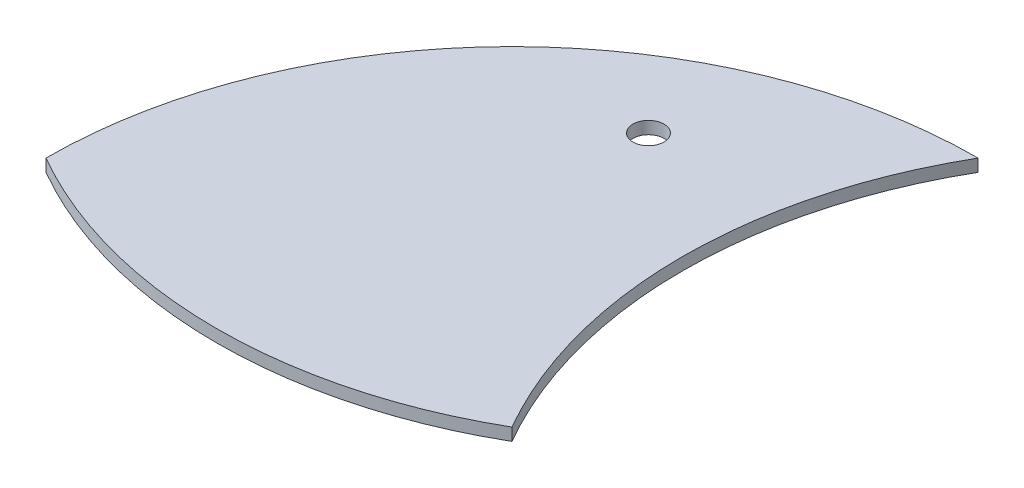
ISO-10303-21;
HEADER;
FILE_DESCRIPTION(('STEP AP214'),'2;1');
FILE_NAME('part.step','',(''),(''),'','','');
FILE_SCHEMA(('AUTOMOTIVE_DESIGN { 1 0 10303 214 1 1 1 1 }'));
ENDSEC;
DATA;
#1=APPLICATION_CONTEXT('core data for automotive mechanical design processes');
#2=APPLICATION_PROTOCOL_DEFINITION('international standard','automotive_design',2000,#1);
#3=PRODUCT_CONTEXT('',#1,'mechanical');
#4=PRODUCT('Part','Part','',(#3));
#5=PRODUCT_RELATED_PRODUCT_CATEGORY('part','',(#4));
#6=PRODUCT_DEFINITION_FORMATION('','',#4);
#7=PRODUCT_DEFINITION_CONTEXT('part definition',#1,'design');
#8=PRODUCT_DEFINITION('design','',#6,#7);
#9=PRODUCT_DEFINITION_SHAPE('','',#8);
#10=(LENGTH_UNIT() NAMED_UNIT(*) SI_UNIT(.MILLI.,.METRE.));
#11=(NAMED_UNIT(*) PLANE_ANGLE_UNIT() SI_UNIT($,.RADIAN.));
#12=(NAMED_UNIT(*) SI_UNIT($,.STERADIAN.) SOLID_ANGLE_UNIT());
#13=UNCERTAINTY_MEASURE_WITH_UNIT(LENGTH_MEASURE(1.E-05),#10,'distance_accuracy_value','');
#14=(GEOMETRIC_REPRESENTATION_CONTEXT(3) GLOBAL_UNCERTAINTY_ASSIGNED_CONTEXT((#13)) GLOBAL_UNIT_ASSIGNED_CONTEXT((#10,
#11,#12)) REPRESENTATION_CONTEXT('',''));
#15=CARTESIAN_POINT('',(0.,0.,0.));
#16=DIRECTION('',(0.,0.,1.));
#17=DIRECTION('',(1.,0.,0.));
#18=AXIS2_PLACEMENT_3D('',#15,#16,#17);
#19=CARTESIAN_POINT('',(32.4759526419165,1.,-18.75));
#20=DIRECTION('',(0.,-1.,0.));
#21=DIRECTION('',(0.,0.,-1.));
#22=AXIS2_PLACEMENT_3D('',#19,#20,#21);
#23=CYLINDRICAL_SURFACE('',#22,37.5);
#24=CARTESIAN_POINT('',(32.4759526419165,0.,-18.75));
#25=DIRECTION('',(0.,1.,0.));
#26=DIRECTION('',(0.,0.,1.));
#27=AXIS2_PLACEMENT_3D('',#24,#25,#26);
#28=CIRCLE('',#27,37.5);
#29=CARTESIAN_POINT('',(0.,0.,-37.5));
#30=VERTEX_POINT('',#29);
#31=CARTESIAN_POINT('',(0.,0.,0.));
#32=VERTEX_POINT('',#31);
#33=EDGE_CURVE('E77',#30,#32,#28,.T.);
#34=ORIENTED_EDGE('',*,*,#33,.F.);
#35=DIRECTION('',(0.,-1.,0.));
#36=VECTOR('',#35,1.);
#37=CARTESIAN_POINT('',(0.,1.,-37.5));
#38=LINE('',#37,#36);
#39=CARTESIAN_POINT('',(0.,1.,-37.5));
#40=VERTEX_POINT('',#39);
#41=EDGE_CURVE('E11',#40,#30,#38,.T.);
#42=ORIENTED_EDGE('',*,*,#41,.F.);
#43=CARTESIAN_POINT('',(32.4759526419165,1.,-18.75));
#44=DIRECTION('',(0.,1.,0.));
#45=DIRECTION('',(0.,0.,1.));
#46=AXIS2_PLACEMENT_3D('',#43,#44,#45);
#47=CIRCLE('',#46,37.5);
#48=CARTESIAN_POINT('',(0.,1.,0.));
#49=VERTEX_POINT('',#48);
#50=EDGE_CURVE('E76',#40,#49,#47,.T.);
#51=ORIENTED_EDGE('',*,*,#50,.T.);
#52=DIRECTION('',(0.,-1.,0.));
#53=VECTOR('',#52,1.);
#54=CARTESIAN_POINT('',(0.,1.,0.));
#55=LINE('',#54,#53);
#56=EDGE_CURVE('E73',#49,#32,#55,.T.);
#57=ORIENTED_EDGE('',*,*,#56,.T.);
#58=EDGE_LOOP('',(#34,#42,#51,#57));
#59=FACE_BOUND('',#58,.T.);
#60=ADVANCED_FACE('F37',(#59),#23,.F.);
#61=CARTESIAN_POINT('',(0.,1.,0.));
#62=DIRECTION('',(0.,-1.,0.));
#63=DIRECTION('',(0.,0.,-1.));
#64=AXIS2_PLACEMENT_3D('',#61,#62,#63);
#65=CYLINDRICAL_SURFACE('',#64,37.5);
#66=CARTESIAN_POINT('',(0.,0.,0.));
#67=DIRECTION('',(0.,1.,0.));
#68=DIRECTION('',(0.,0.,1.));
#69=AXIS2_PLACEMENT_3D('',#66,#67,#68);
#70=CIRCLE('',#69,37.5);
#71=CARTESIAN_POINT('',(-37.5,0.,0.));
#72=VERTEX_POINT('',#71);
#73=EDGE_CURVE('E95',#30,#72,#70,.T.);
#74=ORIENTED_EDGE('',*,*,#73,.T.);
#75=DIRECTION('',(0.,-1.,0.));
#76=VECTOR('',#75,1.);
#77=CARTESIAN_POINT('',(-37.5,1.,0.));
#78=LINE('',#77,#76);
#79=CARTESIAN_POINT('',(-37.5,1.,0.));
#80=VERTEX_POINT('',#79);
#81=EDGE_CURVE('E46',#80,#72,#78,.T.);
#82=ORIENTED_EDGE('',*,*,#81,.F.);
#83=CARTESIAN_POINT('',(0.,1.,0.));
#84=DIRECTION('',(0.,1.,0.));
#85=DIRECTION('',(0.,0.,1.));
#86=AXIS2_PLACEMENT_3D('',#83,#84,#85);
#87=CIRCLE('',#86,37.5);
#88=EDGE_CURVE('E81',#40,#80,#87,.T.);
#89=ORIENTED_EDGE('',*,*,#88,.F.);
#90=ORIENTED_EDGE('',*,*,#41,.T.);
#91=EDGE_LOOP('',(#74,#82,#89,#90));
#92=FACE_BOUND('',#91,.T.);
#93=ADVANCED_FACE('F82',(#92),#65,.T.);
#94=CARTESIAN_POINT('',(-15.,1.,-25.9807621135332));
#95=DIRECTION('',(0.,-1.,0.));
#96=DIRECTION('',(0.,0.,-1.));
#97=AXIS2_PLACEMENT_3D('',#94,#95,#96);
#98=CYLINDRICAL_SURFACE('',#97,1.25);
#99=CARTESIAN_POINT('',(-15.,1.,-25.9807621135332));
#100=DIRECTION('',(0.,1.,0.));
#101=DIRECTION('',(0.,0.,1.));
#102=AXIS2_PLACEMENT_3D('',#99,#100,#101);
#103=CIRCLE('',#102,1.25);
#104=CARTESIAN_POINT('',(-15.,1.,-24.7307621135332));
#105=VERTEX_POINT('',#104);
#106=EDGE_CURVE('E85',#105,#105,#103,.T.);
#107=ORIENTED_EDGE('',*,*,#106,.T.);
#108=EDGE_LOOP('',(#107));
#109=FACE_BOUND('',#108,.T.);
#110=CARTESIAN_POINT('',(-15.,0.,-25.9807621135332));
#111=DIRECTION('',(0.,1.,0.));
#112=DIRECTION('',(0.,0.,1.));
#113=AXIS2_PLACEMENT_3D('',#110,#111,#112);
#114=CIRCLE('',#113,1.25);
#115=CARTESIAN_POINT('',(-15.,0.,-24.7307621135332));
#116=VERTEX_POINT('',#115);
#117=EDGE_CURVE('E91',#116,#116,#114,.T.);
#118=ORIENTED_EDGE('',*,*,#117,.F.);
#119=EDGE_LOOP('',(#118));
#120=FACE_BOUND('',#119,.T.);
#121=ADVANCED_FACE('F39',(#109,#120),#98,.F.);
#122=CARTESIAN_POINT('',(-18.75,1.,-32.4759526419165));
#123=DIRECTION('',(0.,-1.,0.));
#124=DIRECTION('',(0.,0.,-1.));
#125=AXIS2_PLACEMENT_3D('',#122,#123,#124);
#126=CYLINDRICAL_SURFACE('',#125,37.5);
#127=CARTESIAN_POINT('',(-18.75,0.,-32.4759526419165));
#128=DIRECTION('',(0.,1.,0.));
#129=DIRECTION('',(0.,0.,1.));
#130=AXIS2_PLACEMENT_3D('',#127,#128,#129);
#131=CIRCLE('',#130,37.5);
#132=EDGE_CURVE('E67',#72,#32,#131,.T.);
#133=ORIENTED_EDGE('',*,*,#132,.T.);
#134=ORIENTED_EDGE('',*,*,#56,.F.);
#135=CARTESIAN_POINT('',(-18.75,1.,-32.4759526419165));
#136=DIRECTION('',(0.,1.,0.));
#137=DIRECTION('',(0.,0.,1.));
#138=AXIS2_PLACEMENT_3D('',#135,#136,#137);
#139=CIRCLE('',#138,37.5);
#140=EDGE_CURVE('E54',#80,#49,#139,.T.);
#141=ORIENTED_EDGE('',*,*,#140,.F.);
#142=ORIENTED_EDGE('',*,*,#81,.T.);
#143=EDGE_LOOP('',(#133,#134,#141,#142));
#144=FACE_BOUND('',#143,.T.);
#145=ADVANCED_FACE('F99',(#144),#126,.T.);
#146=CARTESIAN_POINT('',(0.,1.,0.));
#147=DIRECTION('',(0.,1.,0.));
#148=DIRECTION('',(0.,0.,1.));
#149=AXIS2_PLACEMENT_3D('',#146,#147,#148);
#150=PLANE('',#149);
#151=ORIENTED_EDGE('',*,*,#106,.F.);
#152=EDGE_LOOP('',(#151));
#153=FACE_BOUND('',#152,.T.);
#154=ORIENTED_EDGE('',*,*,#50,.F.);
#155=ORIENTED_EDGE('',*,*,#88,.T.);
#156=ORIENTED_EDGE('',*,*,#140,.T.);
#157=EDGE_LOOP('',(#154,#155,#156));
#158=FACE_BOUND('',#157,.T.);
#159=ADVANCED_FACE('F84',(#153,#158),#150,.T.);
#160=CARTESIAN_POINT('',(0.,0.,0.));
#161=DIRECTION('',(0.,1.,0.));
#162=DIRECTION('',(0.,0.,1.));
#163=AXIS2_PLACEMENT_3D('',#160,#161,#162);
#164=PLANE('',#163);
#165=ORIENTED_EDGE('',*,*,#117,.T.);
#166=EDGE_LOOP('',(#165));
#167=FACE_BOUND('',#166,.T.);
#168=ORIENTED_EDGE('',*,*,#33,.T.);
#169=ORIENTED_EDGE('',*,*,#132,.F.);
#170=ORIENTED_EDGE('',*,*,#73,.F.);
#171=EDGE_LOOP('',(#168,#169,#170));
#172=FACE_BOUND('',#171,.T.);
#173=ADVANCED_FACE('F100',(#167,#172),#164,.F.);
#174=CLOSED_SHELL('',(#60,#93,#121,#145,#159,#173));
#175=MANIFOLD_SOLID_BREP('B2',#174);
#176=ADVANCED_BREP_SHAPE_REPRESENTATION('',(#18,#175),#14);
#177=SHAPE_DEFINITION_REPRESENTATION(#9,#176);
ENDSEC;
END-ISO-10303-21;
